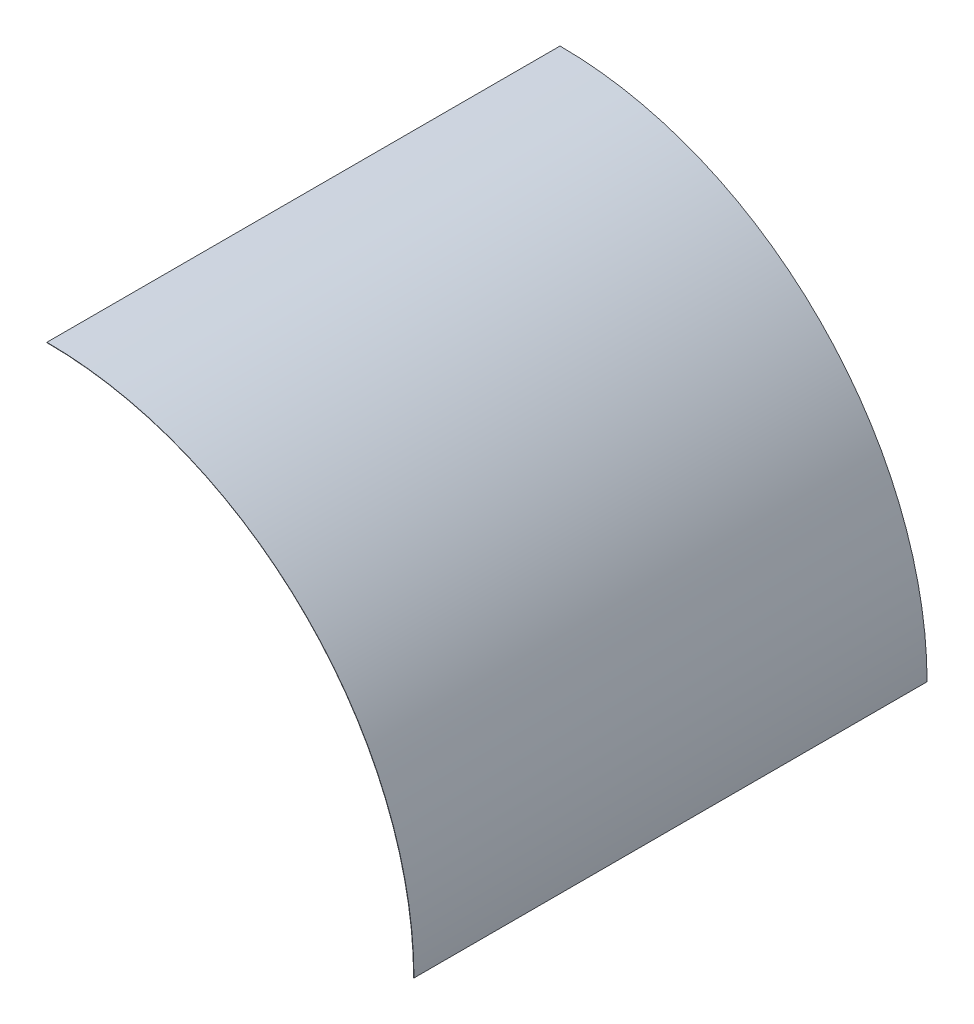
from build123d import *

# Parameters (mm, degrees)
BOSS_EXTRUDE1_DEPTH = 3000


with BuildPart() as part:
    # Sketch1 → Boss-Extrude1 (new body)
    with BuildSketch(Plane.XY):
        with BuildLine():
            Line((0, 2146), (0, 2144))
            ThreePointArc((0, 2144), (1516.036938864, 1516.036938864), (2144, 0))
            Line((2144, 0), (2146, 0))
            ThreePointArc((2146, 0), (1517.451152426, 1517.451152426), (0, 2146))
        make_face()
    extrude(amount=-BOSS_EXTRUDE1_DEPTH)


solid = part.part
